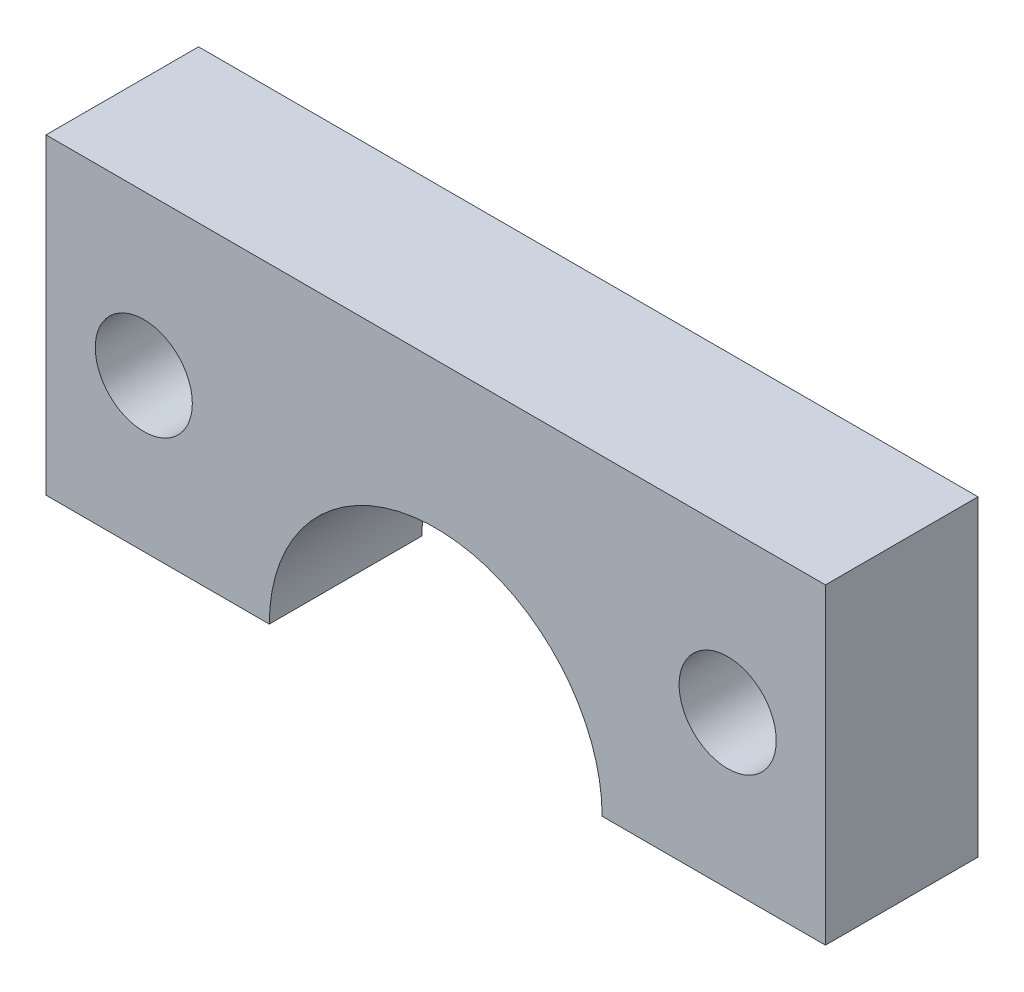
ISO-10303-21;
HEADER;
FILE_DESCRIPTION(('STEP AP214'),'2;1');
FILE_NAME('part.step','',(''),(''),'','','');
FILE_SCHEMA(('AUTOMOTIVE_DESIGN { 1 0 10303 214 1 1 1 1 }'));
ENDSEC;
DATA;
#1=APPLICATION_CONTEXT('core data for automotive mechanical design processes');
#2=APPLICATION_PROTOCOL_DEFINITION('international standard','automotive_design',2000,#1);
#3=PRODUCT_CONTEXT('',#1,'mechanical');
#4=PRODUCT('Part','Part','',(#3));
#5=PRODUCT_RELATED_PRODUCT_CATEGORY('part','',(#4));
#6=PRODUCT_DEFINITION_FORMATION('','',#4);
#7=PRODUCT_DEFINITION_CONTEXT('part definition',#1,'design');
#8=PRODUCT_DEFINITION('design','',#6,#7);
#9=PRODUCT_DEFINITION_SHAPE('','',#8);
#10=(LENGTH_UNIT() NAMED_UNIT(*) SI_UNIT(.MILLI.,.METRE.));
#11=(NAMED_UNIT(*) PLANE_ANGLE_UNIT() SI_UNIT($,.RADIAN.));
#12=(NAMED_UNIT(*) SI_UNIT($,.STERADIAN.) SOLID_ANGLE_UNIT());
#13=UNCERTAINTY_MEASURE_WITH_UNIT(LENGTH_MEASURE(1.E-05),#10,'distance_accuracy_value','');
#14=(GEOMETRIC_REPRESENTATION_CONTEXT(3) GLOBAL_UNCERTAINTY_ASSIGNED_CONTEXT((#13)) GLOBAL_UNIT_ASSIGNED_CONTEXT((#10,
#11,#12)) REPRESENTATION_CONTEXT('',''));
#15=CARTESIAN_POINT('',(0.,0.,0.));
#16=DIRECTION('',(0.,0.,1.));
#17=DIRECTION('',(1.,0.,0.));
#18=AXIS2_PLACEMENT_3D('',#15,#16,#17);
#19=CARTESIAN_POINT('',(-8.55,16.75,5.5));
#20=DIRECTION('',(0.,0.,1.));
#21=DIRECTION('',(1.,0.,0.));
#22=AXIS2_PLACEMENT_3D('',#19,#20,#21);
#23=PLANE('',#22);
#24=CARTESIAN_POINT('',(1.975,22.25,5.5));
#25=DIRECTION('',(0.,0.,1.));
#26=DIRECTION('',(1.,0.,0.));
#27=AXIS2_PLACEMENT_3D('',#24,#25,#26);
#28=CIRCLE('',#27,1.75);
#29=CARTESIAN_POINT('',(3.725,22.25,5.5));
#30=VERTEX_POINT('',#29);
#31=EDGE_CURVE('E133',#30,#30,#28,.T.);
#32=ORIENTED_EDGE('',*,*,#31,.F.);
#33=EDGE_LOOP('',(#32));
#34=FACE_BOUND('',#33,.T.);
#35=CARTESIAN_POINT('',(-8.55,16.75,5.5));
#36=DIRECTION('',(0.,0.,-1.));
#37=DIRECTION('',(1.,0.,0.));
#38=AXIS2_PLACEMENT_3D('',#35,#36,#37);
#39=CIRCLE('',#38,6.);
#40=CARTESIAN_POINT('',(-14.55,16.75,5.5));
#41=VERTEX_POINT('',#40);
#42=CARTESIAN_POINT('',(-2.55,16.75,5.5));
#43=VERTEX_POINT('',#42);
#44=EDGE_CURVE('E146',#41,#43,#39,.T.);
#45=ORIENTED_EDGE('',*,*,#44,.T.);
#46=DIRECTION('',(1.,0.,0.));
#47=VECTOR('',#46,1.);
#48=CARTESIAN_POINT('',(-2.55,16.75,5.5));
#49=LINE('',#48,#47);
#50=CARTESIAN_POINT('',(5.5,16.75,5.5));
#51=VERTEX_POINT('',#50);
#52=EDGE_CURVE('E94',#43,#51,#49,.T.);
#53=ORIENTED_EDGE('',*,*,#52,.T.);
#54=DIRECTION('',(0.,1.,0.));
#55=VECTOR('',#54,1.);
#56=CARTESIAN_POINT('',(5.5,28.,5.5));
#57=LINE('',#56,#55);
#58=CARTESIAN_POINT('',(5.5,28.,5.5));
#59=VERTEX_POINT('',#58);
#60=EDGE_CURVE('E107',#51,#59,#57,.T.);
#61=ORIENTED_EDGE('',*,*,#60,.T.);
#62=DIRECTION('',(-1.,0.,0.));
#63=VECTOR('',#62,1.);
#64=CARTESIAN_POINT('',(2.75,28.,5.5));
#65=LINE('',#64,#63);
#66=CARTESIAN_POINT('',(-22.6,28.,5.5));
#67=VERTEX_POINT('',#66);
#68=EDGE_CURVE('E101',#59,#67,#65,.T.);
#69=ORIENTED_EDGE('',*,*,#68,.T.);
#70=DIRECTION('',(0.,-1.,0.));
#71=VECTOR('',#70,1.);
#72=CARTESIAN_POINT('',(-22.6,28.,5.5));
#73=LINE('',#72,#71);
#74=CARTESIAN_POINT('',(-22.6,16.75,5.5));
#75=VERTEX_POINT('',#74);
#76=EDGE_CURVE('E105',#67,#75,#73,.T.);
#77=ORIENTED_EDGE('',*,*,#76,.T.);
#78=DIRECTION('',(1.,0.,0.));
#79=VECTOR('',#78,1.);
#80=CARTESIAN_POINT('',(-22.6,16.75,5.5));
#81=LINE('',#80,#79);
#82=EDGE_CURVE('E57',#75,#41,#81,.T.);
#83=ORIENTED_EDGE('',*,*,#82,.T.);
#84=EDGE_LOOP('',(#45,#53,#61,#69,#77,#83));
#85=FACE_BOUND('',#84,.T.);
#86=CARTESIAN_POINT('',(-19.075,22.25,5.5));
#87=DIRECTION('',(0.,0.,1.));
#88=DIRECTION('',(1.,0.,0.));
#89=AXIS2_PLACEMENT_3D('',#86,#87,#88);
#90=CIRCLE('',#89,1.75);
#91=CARTESIAN_POINT('',(-17.325,22.25,5.5));
#92=VERTEX_POINT('',#91);
#93=EDGE_CURVE('E192',#92,#92,#90,.T.);
#94=ORIENTED_EDGE('',*,*,#93,.F.);
#95=EDGE_LOOP('',(#94));
#96=FACE_BOUND('',#95,.T.);
#97=ADVANCED_FACE('F39',(#34,#85,#96),#23,.T.);
#98=CARTESIAN_POINT('',(-8.55,16.75,0.));
#99=DIRECTION('',(0.,0.,1.));
#100=DIRECTION('',(1.,0.,0.));
#101=AXIS2_PLACEMENT_3D('',#98,#99,#100);
#102=PLANE('',#101);
#103=CARTESIAN_POINT('',(-8.55,16.75,0.));
#104=DIRECTION('',(0.,0.,-1.));
#105=DIRECTION('',(1.,0.,0.));
#106=AXIS2_PLACEMENT_3D('',#103,#104,#105);
#107=CIRCLE('',#106,6.);
#108=CARTESIAN_POINT('',(-14.55,16.75,0.));
#109=VERTEX_POINT('',#108);
#110=CARTESIAN_POINT('',(-2.55,16.75,0.));
#111=VERTEX_POINT('',#110);
#112=EDGE_CURVE('E128',#109,#111,#107,.T.);
#113=ORIENTED_EDGE('',*,*,#112,.F.);
#114=DIRECTION('',(1.,0.,0.));
#115=VECTOR('',#114,1.);
#116=CARTESIAN_POINT('',(-22.6,16.75,0.));
#117=LINE('',#116,#115);
#118=CARTESIAN_POINT('',(-22.6,16.75,0.));
#119=VERTEX_POINT('',#118);
#120=EDGE_CURVE('E86',#119,#109,#117,.T.);
#121=ORIENTED_EDGE('',*,*,#120,.F.);
#122=DIRECTION('',(0.,-1.,0.));
#123=VECTOR('',#122,1.);
#124=CARTESIAN_POINT('',(-22.6,28.,0.));
#125=LINE('',#124,#123);
#126=CARTESIAN_POINT('',(-22.6,28.,0.));
#127=VERTEX_POINT('',#126);
#128=EDGE_CURVE('E80',#127,#119,#125,.T.);
#129=ORIENTED_EDGE('',*,*,#128,.F.);
#130=DIRECTION('',(-1.,0.,0.));
#131=VECTOR('',#130,1.);
#132=CARTESIAN_POINT('',(-19.85,28.,0.));
#133=LINE('',#132,#131);
#134=CARTESIAN_POINT('',(5.5,28.,0.));
#135=VERTEX_POINT('',#134);
#136=EDGE_CURVE('E115',#135,#127,#133,.T.);
#137=ORIENTED_EDGE('',*,*,#136,.F.);
#138=DIRECTION('',(0.,1.,0.));
#139=VECTOR('',#138,1.);
#140=CARTESIAN_POINT('',(5.5,28.,0.));
#141=LINE('',#140,#139);
#142=CARTESIAN_POINT('',(5.5,16.75,0.));
#143=VERTEX_POINT('',#142);
#144=EDGE_CURVE('E136',#143,#135,#141,.T.);
#145=ORIENTED_EDGE('',*,*,#144,.F.);
#146=DIRECTION('',(1.,0.,0.));
#147=VECTOR('',#146,1.);
#148=CARTESIAN_POINT('',(-2.55,16.75,0.));
#149=LINE('',#148,#147);
#150=EDGE_CURVE('E132',#111,#143,#149,.T.);
#151=ORIENTED_EDGE('',*,*,#150,.F.);
#152=EDGE_LOOP('',(#113,#121,#129,#137,#145,#151));
#153=FACE_BOUND('',#152,.T.);
#154=CARTESIAN_POINT('',(1.975,22.25,0.));
#155=DIRECTION('',(0.,0.,1.));
#156=DIRECTION('',(1.,0.,0.));
#157=AXIS2_PLACEMENT_3D('',#154,#155,#156);
#158=CIRCLE('',#157,1.75);
#159=CARTESIAN_POINT('',(3.725,22.25,0.));
#160=VERTEX_POINT('',#159);
#161=EDGE_CURVE('E200',#160,#160,#158,.T.);
#162=ORIENTED_EDGE('',*,*,#161,.T.);
#163=EDGE_LOOP('',(#162));
#164=FACE_BOUND('',#163,.T.);
#165=CARTESIAN_POINT('',(-19.075,22.25,0.));
#166=DIRECTION('',(0.,0.,1.));
#167=DIRECTION('',(1.,0.,0.));
#168=AXIS2_PLACEMENT_3D('',#165,#166,#167);
#169=CIRCLE('',#168,1.75);
#170=CARTESIAN_POINT('',(-17.325,22.25,0.));
#171=VERTEX_POINT('',#170);
#172=EDGE_CURVE('E195',#171,#171,#169,.T.);
#173=ORIENTED_EDGE('',*,*,#172,.T.);
#174=EDGE_LOOP('',(#173));
#175=FACE_BOUND('',#174,.T.);
#176=ADVANCED_FACE('F159',(#153,#164,#175),#102,.F.);
#177=CARTESIAN_POINT('',(-8.55,16.75,5.5));
#178=DIRECTION('',(0.,0.,-1.));
#179=DIRECTION('',(-1.,0.,0.));
#180=AXIS2_PLACEMENT_3D('',#177,#178,#179);
#181=CYLINDRICAL_SURFACE('',#180,6.);
#182=ORIENTED_EDGE('',*,*,#112,.T.);
#183=DIRECTION('',(0.,0.,-1.));
#184=VECTOR('',#183,1.);
#185=CARTESIAN_POINT('',(-2.55,16.75,5.5));
#186=LINE('',#185,#184);
#187=EDGE_CURVE('E11',#43,#111,#186,.T.);
#188=ORIENTED_EDGE('',*,*,#187,.F.);
#189=ORIENTED_EDGE('',*,*,#44,.F.);
#190=DIRECTION('',(0.,0.,-1.));
#191=VECTOR('',#190,1.);
#192=CARTESIAN_POINT('',(-14.55,16.75,5.5));
#193=LINE('',#192,#191);
#194=EDGE_CURVE('E124',#41,#109,#193,.T.);
#195=ORIENTED_EDGE('',*,*,#194,.T.);
#196=EDGE_LOOP('',(#182,#188,#189,#195));
#197=FACE_BOUND('',#196,.T.);
#198=ADVANCED_FACE('F41',(#197),#181,.F.);
#199=CARTESIAN_POINT('',(-2.55,16.75,5.5));
#200=DIRECTION('',(0.,1.,0.));
#201=DIRECTION('',(-1.,0.,0.));
#202=AXIS2_PLACEMENT_3D('',#199,#200,#201);
#203=PLANE('',#202);
#204=ORIENTED_EDGE('',*,*,#150,.T.);
#205=DIRECTION('',(0.,0.,-1.));
#206=VECTOR('',#205,1.);
#207=CARTESIAN_POINT('',(5.5,16.75,5.5));
#208=LINE('',#207,#206);
#209=EDGE_CURVE('E49',#51,#143,#208,.T.);
#210=ORIENTED_EDGE('',*,*,#209,.F.);
#211=ORIENTED_EDGE('',*,*,#52,.F.);
#212=ORIENTED_EDGE('',*,*,#187,.T.);
#213=EDGE_LOOP('',(#204,#210,#211,#212));
#214=FACE_BOUND('',#213,.T.);
#215=ADVANCED_FACE('F247',(#214),#203,.F.);
#216=CARTESIAN_POINT('',(5.5,28.,5.5));
#217=DIRECTION('',(-1.,0.,0.));
#218=DIRECTION('',(0.,0.,1.));
#219=AXIS2_PLACEMENT_3D('',#216,#217,#218);
#220=PLANE('',#219);
#221=ORIENTED_EDGE('',*,*,#144,.T.);
#222=DIRECTION('',(0.,0.,-1.));
#223=VECTOR('',#222,1.);
#224=CARTESIAN_POINT('',(5.5,28.,5.5));
#225=LINE('',#224,#223);
#226=EDGE_CURVE('E117',#59,#135,#225,.T.);
#227=ORIENTED_EDGE('',*,*,#226,.F.);
#228=ORIENTED_EDGE('',*,*,#60,.F.);
#229=ORIENTED_EDGE('',*,*,#209,.T.);
#230=EDGE_LOOP('',(#221,#227,#228,#229));
#231=FACE_BOUND('',#230,.T.);
#232=ADVANCED_FACE('F156',(#231),#220,.F.);
#233=CARTESIAN_POINT('',(-19.85,28.,5.5));
#234=DIRECTION('',(0.,-1.,0.));
#235=DIRECTION('',(0.,0.,-1.));
#236=AXIS2_PLACEMENT_3D('',#233,#234,#235);
#237=PLANE('',#236);
#238=ORIENTED_EDGE('',*,*,#136,.T.);
#239=DIRECTION('',(0.,0.,-1.));
#240=VECTOR('',#239,1.);
#241=CARTESIAN_POINT('',(-22.6,28.,5.5));
#242=LINE('',#241,#240);
#243=EDGE_CURVE('E113',#67,#127,#242,.T.);
#244=ORIENTED_EDGE('',*,*,#243,.F.);
#245=ORIENTED_EDGE('',*,*,#68,.F.);
#246=ORIENTED_EDGE('',*,*,#226,.T.);
#247=EDGE_LOOP('',(#238,#244,#245,#246));
#248=FACE_BOUND('',#247,.T.);
#249=ADVANCED_FACE('F114',(#248),#237,.F.);
#250=CARTESIAN_POINT('',(-22.6,28.,5.5));
#251=DIRECTION('',(1.,0.,0.));
#252=DIRECTION('',(0.,0.,-1.));
#253=AXIS2_PLACEMENT_3D('',#250,#251,#252);
#254=PLANE('',#253);
#255=ORIENTED_EDGE('',*,*,#128,.T.);
#256=DIRECTION('',(0.,0.,-1.));
#257=VECTOR('',#256,1.);
#258=CARTESIAN_POINT('',(-22.6,16.75,5.5));
#259=LINE('',#258,#257);
#260=EDGE_CURVE('E118',#75,#119,#259,.T.);
#261=ORIENTED_EDGE('',*,*,#260,.F.);
#262=ORIENTED_EDGE('',*,*,#76,.F.);
#263=ORIENTED_EDGE('',*,*,#243,.T.);
#264=EDGE_LOOP('',(#255,#261,#262,#263));
#265=FACE_BOUND('',#264,.T.);
#266=ADVANCED_FACE('F120',(#265),#254,.F.);
#267=CARTESIAN_POINT('',(-22.6,16.75,5.5));
#268=DIRECTION('',(0.,1.,0.));
#269=DIRECTION('',(0.,0.,1.));
#270=AXIS2_PLACEMENT_3D('',#267,#268,#269);
#271=PLANE('',#270);
#272=ORIENTED_EDGE('',*,*,#120,.T.);
#273=ORIENTED_EDGE('',*,*,#194,.F.);
#274=ORIENTED_EDGE('',*,*,#82,.F.);
#275=ORIENTED_EDGE('',*,*,#260,.T.);
#276=EDGE_LOOP('',(#272,#273,#274,#275));
#277=FACE_BOUND('',#276,.T.);
#278=ADVANCED_FACE('F164',(#277),#271,.F.);
#279=CARTESIAN_POINT('',(1.975,22.25,5.5));
#280=DIRECTION('',(0.,0.,-1.));
#281=DIRECTION('',(-1.,0.,0.));
#282=AXIS2_PLACEMENT_3D('',#279,#280,#281);
#283=CYLINDRICAL_SURFACE('',#282,1.75);
#284=ORIENTED_EDGE('',*,*,#31,.T.);
#285=EDGE_LOOP('',(#284));
#286=FACE_BOUND('',#285,.T.);
#287=ORIENTED_EDGE('',*,*,#161,.F.);
#288=EDGE_LOOP('',(#287));
#289=FACE_BOUND('',#288,.T.);
#290=ADVANCED_FACE('F166',(#286,#289),#283,.F.);
#291=CARTESIAN_POINT('',(-19.075,22.25,5.5));
#292=DIRECTION('',(0.,0.,-1.));
#293=DIRECTION('',(-1.,0.,0.));
#294=AXIS2_PLACEMENT_3D('',#291,#292,#293);
#295=CYLINDRICAL_SURFACE('',#294,1.75);
#296=ORIENTED_EDGE('',*,*,#93,.T.);
#297=EDGE_LOOP('',(#296));
#298=FACE_BOUND('',#297,.T.);
#299=ORIENTED_EDGE('',*,*,#172,.F.);
#300=EDGE_LOOP('',(#299));
#301=FACE_BOUND('',#300,.T.);
#302=ADVANCED_FACE('F172',(#298,#301),#295,.F.);
#303=CLOSED_SHELL('',(#97,#176,#198,#215,#232,#249,#266,#278,#290,#302));
#304=MANIFOLD_SOLID_BREP('B2',#303);
#305=ADVANCED_BREP_SHAPE_REPRESENTATION('',(#18,#304),#14);
#306=SHAPE_DEFINITION_REPRESENTATION(#9,#305);
ENDSEC;
END-ISO-10303-21;
